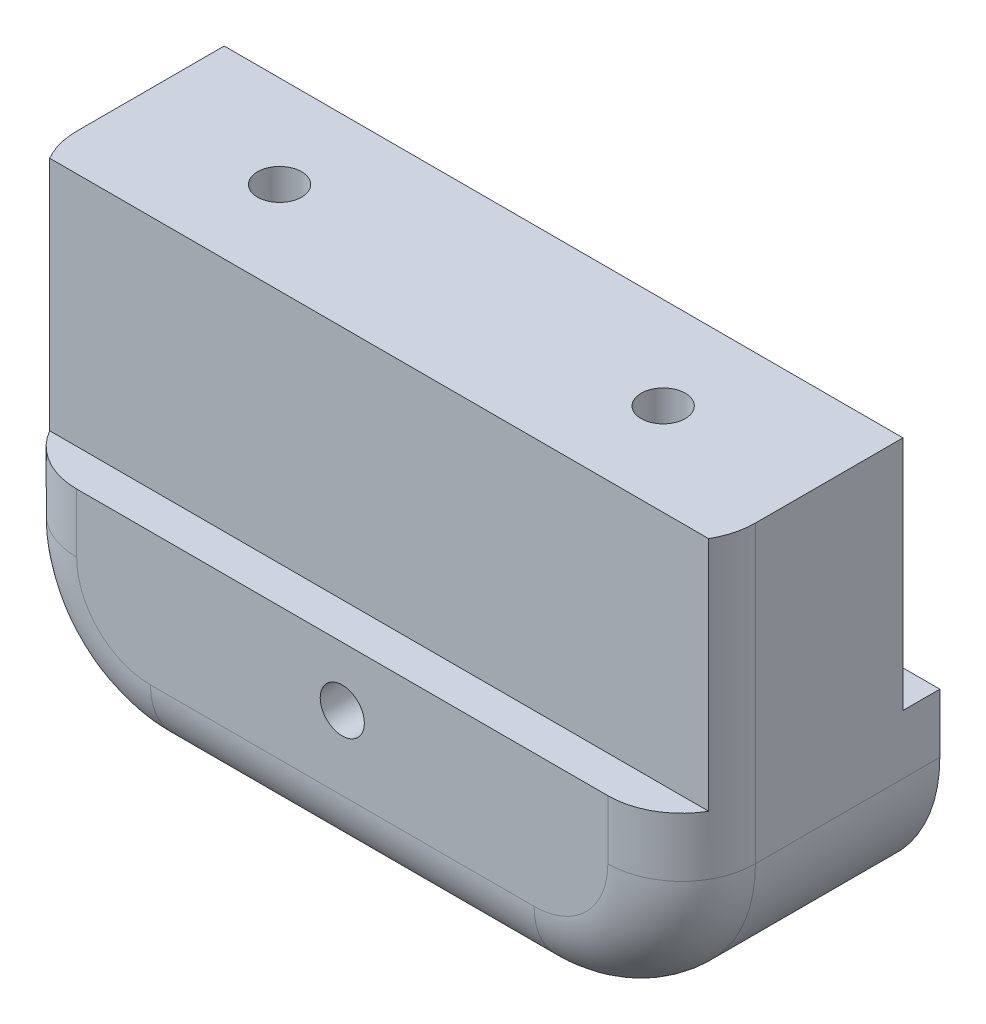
ISO-10303-21;
HEADER;
FILE_DESCRIPTION(('STEP AP214'),'2;1');
FILE_NAME('part.step','',(''),(''),'','','');
FILE_SCHEMA(('AUTOMOTIVE_DESIGN { 1 0 10303 214 1 1 1 1 }'));
ENDSEC;
DATA;
#1=APPLICATION_CONTEXT('core data for automotive mechanical design processes');
#2=APPLICATION_PROTOCOL_DEFINITION('international standard','automotive_design',2000,#1);
#3=PRODUCT_CONTEXT('',#1,'mechanical');
#4=PRODUCT('Part','Part','',(#3));
#5=PRODUCT_RELATED_PRODUCT_CATEGORY('part','',(#4));
#6=PRODUCT_DEFINITION_FORMATION('','',#4);
#7=PRODUCT_DEFINITION_CONTEXT('part definition',#1,'design');
#8=PRODUCT_DEFINITION('design','',#6,#7);
#9=PRODUCT_DEFINITION_SHAPE('','',#8);
#10=(LENGTH_UNIT() NAMED_UNIT(*) SI_UNIT(.MILLI.,.METRE.));
#11=(NAMED_UNIT(*) PLANE_ANGLE_UNIT() SI_UNIT($,.RADIAN.));
#12=(NAMED_UNIT(*) SI_UNIT($,.STERADIAN.) SOLID_ANGLE_UNIT());
#13=UNCERTAINTY_MEASURE_WITH_UNIT(LENGTH_MEASURE(1.E-05),#10,'distance_accuracy_value','');
#14=(GEOMETRIC_REPRESENTATION_CONTEXT(3) GLOBAL_UNCERTAINTY_ASSIGNED_CONTEXT((#13)) GLOBAL_UNIT_ASSIGNED_CONTEXT((#10,
#11,#12)) REPRESENTATION_CONTEXT('',''));
#15=CARTESIAN_POINT('',(0.,0.,0.));
#16=DIRECTION('',(0.,0.,1.));
#17=DIRECTION('',(1.,0.,0.));
#18=AXIS2_PLACEMENT_3D('',#15,#16,#17);
#19=CARTESIAN_POINT('',(75.5650000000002,-140.462,22.225));
#20=DIRECTION('',(0.,-1.,0.));
#21=DIRECTION('',(1.,0.,0.));
#22=AXIS2_PLACEMENT_3D('',#19,#20,#21);
#23=PLANE('',#22);
#24=CARTESIAN_POINT('',(128.905,-140.462,11.1125));
#25=DIRECTION('',(0.,1.,0.));
#26=DIRECTION('',(0.,0.,1.));
#27=AXIS2_PLACEMENT_3D('',#24,#25,#26);
#28=CIRCLE('',#27,1.89865);
#29=CARTESIAN_POINT('',(128.905,-140.462,13.01115));
#30=VERTEX_POINT('',#29);
#31=EDGE_CURVE('E160',#30,#30,#28,.T.);
#32=ORIENTED_EDGE('',*,*,#31,.F.);
#33=EDGE_LOOP('',(#32));
#34=FACE_BOUND('',#33,.T.);
#35=CARTESIAN_POINT('',(161.925,-140.462,11.1125));
#36=DIRECTION('',(0.,1.,0.));
#37=DIRECTION('',(0.,0.,1.));
#38=AXIS2_PLACEMENT_3D('',#35,#36,#37);
#39=CIRCLE('',#38,1.89865);
#40=CARTESIAN_POINT('',(161.925,-140.462,13.01115));
#41=VERTEX_POINT('',#40);
#42=EDGE_CURVE('E159',#41,#41,#39,.T.);
#43=ORIENTED_EDGE('',*,*,#42,.F.);
#44=EDGE_LOOP('',(#43));
#45=FACE_BOUND('',#44,.T.);
#46=DIRECTION('',(1.,0.,0.));
#47=VECTOR('',#46,1.);
#48=CARTESIAN_POINT('',(75.5650000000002,-140.462,3.175));
#49=LINE('',#48,#47);
#50=CARTESIAN_POINT('',(116.205,-140.462,3.175));
#51=VERTEX_POINT('',#50);
#52=CARTESIAN_POINT('',(174.625,-140.462,3.175));
#53=VERTEX_POINT('',#52);
#54=EDGE_CURVE('E309',#51,#53,#49,.T.);
#55=ORIENTED_EDGE('',*,*,#54,.F.);
#56=DIRECTION('',(0.,0.,1.));
#57=VECTOR('',#56,1.);
#58=CARTESIAN_POINT('',(116.205,-140.462,22.225));
#59=LINE('',#58,#57);
#60=CARTESIAN_POINT('',(116.205,-140.462,15.875));
#61=VERTEX_POINT('',#60);
#62=EDGE_CURVE('E341',#51,#61,#59,.T.);
#63=ORIENTED_EDGE('',*,*,#62,.T.);
#64=CARTESIAN_POINT('',(122.555,-140.462,15.875));
#65=DIRECTION('',(0.,-1.,0.));
#66=DIRECTION('',(1.,0.,0.));
#67=AXIS2_PLACEMENT_3D('',#64,#65,#66);
#68=CIRCLE('',#67,6.35);
#69=CARTESIAN_POINT('',(117.055738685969,-140.462,19.05));
#70=VERTEX_POINT('',#69);
#71=EDGE_CURVE('E193',#61,#70,#68,.F.);
#72=ORIENTED_EDGE('',*,*,#71,.T.);
#73=DIRECTION('',(1.,0.,0.));
#74=VECTOR('',#73,1.);
#75=CARTESIAN_POINT('',(174.625,-140.462,19.05));
#76=LINE('',#75,#74);
#77=CARTESIAN_POINT('',(173.774261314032,-140.462,19.05));
#78=VERTEX_POINT('',#77);
#79=EDGE_CURVE('E347',#70,#78,#76,.T.);
#80=ORIENTED_EDGE('',*,*,#79,.T.);
#81=CARTESIAN_POINT('',(168.275,-140.462,15.875));
#82=DIRECTION('',(0.,-1.,0.));
#83=DIRECTION('',(1.,0.,0.));
#84=AXIS2_PLACEMENT_3D('',#81,#82,#83);
#85=CIRCLE('',#84,6.35);
#86=CARTESIAN_POINT('',(174.625,-140.462,15.875));
#87=VERTEX_POINT('',#86);
#88=EDGE_CURVE('E191',#78,#87,#85,.F.);
#89=ORIENTED_EDGE('',*,*,#88,.T.);
#90=DIRECTION('',(0.,0.,-1.));
#91=VECTOR('',#90,1.);
#92=CARTESIAN_POINT('',(174.625,-140.462,22.225));
#93=LINE('',#92,#91);
#94=EDGE_CURVE('E169',#87,#53,#93,.T.);
#95=ORIENTED_EDGE('',*,*,#94,.T.);
#96=EDGE_LOOP('',(#55,#63,#72,#80,#89,#95));
#97=FACE_BOUND('',#96,.T.);
#98=ADVANCED_FACE('F39',(#34,#45,#97),#23,.F.);
#99=CARTESIAN_POINT('',(174.625,-140.462,22.225));
#100=DIRECTION('',(-1.,0.,0.));
#101=DIRECTION('',(0.,-1.,0.));
#102=AXIS2_PLACEMENT_3D('',#99,#100,#101);
#103=PLANE('',#102);
#104=DIRECTION('',(0.,1.,0.));
#105=VECTOR('',#104,1.);
#106=CARTESIAN_POINT('',(174.625,-140.462,0.));
#107=LINE('',#106,#105);
#108=CARTESIAN_POINT('',(174.625,-165.862,0.));
#109=VERTEX_POINT('',#108);
#110=CARTESIAN_POINT('',(174.625,-160.782,0.));
#111=VERTEX_POINT('',#110);
#112=EDGE_CURVE('E287',#109,#111,#107,.T.);
#113=ORIENTED_EDGE('',*,*,#112,.T.);
#114=DIRECTION('',(0.,0.,1.));
#115=VECTOR('',#114,1.);
#116=CARTESIAN_POINT('',(174.625,-160.782,22.225));
#117=LINE('',#116,#115);
#118=CARTESIAN_POINT('',(174.625,-160.782,3.175));
#119=VERTEX_POINT('',#118);
#120=EDGE_CURVE('E215',#111,#119,#117,.T.);
#121=ORIENTED_EDGE('',*,*,#120,.T.);
#122=DIRECTION('',(0.,-1.,0.));
#123=VECTOR('',#122,1.);
#124=CARTESIAN_POINT('',(174.625,-140.462,3.175));
#125=LINE('',#124,#123);
#126=EDGE_CURVE('E314',#53,#119,#125,.T.);
#127=ORIENTED_EDGE('',*,*,#126,.F.);
#128=ORIENTED_EDGE('',*,*,#94,.F.);
#129=DIRECTION('',(0.,1.,0.));
#130=VECTOR('',#129,1.);
#131=CARTESIAN_POINT('',(174.624999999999,-165.862,15.875));
#132=LINE('',#131,#130);
#133=CARTESIAN_POINT('',(174.625,-165.862,15.875));
#134=VERTEX_POINT('',#133);
#135=EDGE_CURVE('E205',#87,#134,#132,.F.);
#136=ORIENTED_EDGE('',*,*,#135,.T.);
#137=DIRECTION('',(0.,0.,-1.));
#138=VECTOR('',#137,1.);
#139=CARTESIAN_POINT('',(174.625,-165.862,22.225));
#140=LINE('',#139,#138);
#141=EDGE_CURVE('E167',#134,#109,#140,.T.);
#142=ORIENTED_EDGE('',*,*,#141,.T.);
#143=EDGE_LOOP('',(#113,#121,#127,#128,#136,#142));
#144=FACE_BOUND('',#143,.T.);
#145=ADVANCED_FACE('F271',(#144),#103,.F.);
#146=CARTESIAN_POINT('',(161.925,-165.862,22.225));
#147=DIRECTION('',(0.,0.,1.));
#148=DIRECTION('',(1.,0.,0.));
#149=AXIS2_PLACEMENT_3D('',#146,#147,#148);
#150=PLANE('',#149);
#151=DIRECTION('',(-1.,0.,0.));
#152=VECTOR('',#151,1.);
#153=CARTESIAN_POINT('',(174.625,-160.782,22.225));
#154=LINE('',#153,#152);
#155=CARTESIAN_POINT('',(168.275,-160.782,22.225));
#156=VERTEX_POINT('',#155);
#157=CARTESIAN_POINT('',(122.555,-160.782,22.225));
#158=VERTEX_POINT('',#157);
#159=EDGE_CURVE('E343',#156,#158,#154,.T.);
#160=ORIENTED_EDGE('',*,*,#159,.T.);
#161=DIRECTION('',(0.,-1.,0.));
#162=VECTOR('',#161,1.);
#163=CARTESIAN_POINT('',(122.555,-165.862,22.225));
#164=LINE('',#163,#162);
#165=CARTESIAN_POINT('',(122.555,-165.862,22.225));
#166=VERTEX_POINT('',#165);
#167=EDGE_CURVE('E185',#158,#166,#164,.T.);
#168=ORIENTED_EDGE('',*,*,#167,.T.);
#169=CARTESIAN_POINT('',(128.905,-165.862,22.225));
#170=DIRECTION('',(0.,0.,1.));
#171=DIRECTION('',(1.,0.,0.));
#172=AXIS2_PLACEMENT_3D('',#169,#170,#171);
#173=CIRCLE('',#172,6.35);
#174=CARTESIAN_POINT('',(128.905,-172.212,22.225));
#175=VERTEX_POINT('',#174);
#176=EDGE_CURVE('E183',#166,#175,#173,.T.);
#177=ORIENTED_EDGE('',*,*,#176,.T.);
#178=DIRECTION('',(1.,0.,0.));
#179=VECTOR('',#178,1.);
#180=CARTESIAN_POINT('',(161.925,-172.212,22.225));
#181=LINE('',#180,#179);
#182=CARTESIAN_POINT('',(161.925,-172.212,22.225));
#183=VERTEX_POINT('',#182);
#184=EDGE_CURVE('E177',#175,#183,#181,.T.);
#185=ORIENTED_EDGE('',*,*,#184,.T.);
#186=CARTESIAN_POINT('',(161.925,-165.862,22.225));
#187=DIRECTION('',(0.,0.,1.));
#188=DIRECTION('',(1.,0.,0.));
#189=AXIS2_PLACEMENT_3D('',#186,#187,#188);
#190=CIRCLE('',#189,6.34999999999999);
#191=CARTESIAN_POINT('',(168.275,-165.862,22.225));
#192=VERTEX_POINT('',#191);
#193=EDGE_CURVE('E179',#183,#192,#190,.T.);
#194=ORIENTED_EDGE('',*,*,#193,.T.);
#195=DIRECTION('',(0.,1.,0.));
#196=VECTOR('',#195,1.);
#197=CARTESIAN_POINT('',(168.275,-160.782,22.225));
#198=LINE('',#197,#196);
#199=EDGE_CURVE('E181',#192,#156,#198,.T.);
#200=ORIENTED_EDGE('',*,*,#199,.T.);
#201=EDGE_LOOP('',(#160,#168,#177,#185,#194,#200));
#202=FACE_BOUND('',#201,.T.);
#203=CARTESIAN_POINT('',(145.415,-165.862,22.225));
#204=DIRECTION('',(0.,0.,-1.));
#205=DIRECTION('',(-1.,0.,0.));
#206=AXIS2_PLACEMENT_3D('',#203,#204,#205);
#207=CIRCLE('',#206,1.89865);
#208=CARTESIAN_POINT('',(143.51635,-165.862,22.225));
#209=VERTEX_POINT('',#208);
#210=EDGE_CURVE('E299',#209,#209,#207,.T.);
#211=ORIENTED_EDGE('',*,*,#210,.T.);
#212=EDGE_LOOP('',(#211));
#213=FACE_BOUND('',#212,.T.);
#214=ADVANCED_FACE('F268',(#202,#213),#150,.T.);
#215=CARTESIAN_POINT('',(161.925,-165.862,22.225));
#216=DIRECTION('',(0.,0.,-1.));
#217=DIRECTION('',(-1.,0.,0.));
#218=AXIS2_PLACEMENT_3D('',#215,#216,#217);
#219=CYLINDRICAL_SURFACE('',#218,12.7);
#220=DIRECTION('',(0.,0.,-1.));
#221=VECTOR('',#220,1.);
#222=CARTESIAN_POINT('',(161.925,-178.562,22.225));
#223=LINE('',#222,#221);
#224=CARTESIAN_POINT('',(161.925,-178.562,15.875));
#225=VERTEX_POINT('',#224);
#226=CARTESIAN_POINT('',(161.925,-178.562,13.01115));
#227=VERTEX_POINT('',#226);
#228=EDGE_CURVE('E303',#225,#227,#223,.T.);
#229=ORIENTED_EDGE('',*,*,#228,.T.);
#230=CARTESIAN_POINT('',(161.925,-178.562,13.01115));
#231=CARTESIAN_POINT('',(161.978102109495,-178.562001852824,13.0111499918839));
#232=CARTESIAN_POINT('',(162.031178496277,-178.561666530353,13.0089208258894));
#233=CARTESIAN_POINT('',(162.136945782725,-178.560341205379,13.0000300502));
#234=CARTESIAN_POINT('',(162.189636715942,-178.559351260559,12.9933688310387));
#235=CARTESIAN_POINT('',(162.346430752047,-178.55543424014,12.9668114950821));
#236=CARTESIAN_POINT('',(162.449474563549,-178.551559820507,12.9403414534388));
#237=CARTESIAN_POINT('',(162.649591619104,-178.541709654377,12.8706480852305));
#238=CARTESIAN_POINT('',(162.746663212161,-178.535733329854,12.8274201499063));
#239=CARTESIAN_POINT('',(162.932187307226,-178.522340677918,12.7254610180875));
#240=CARTESIAN_POINT('',(163.020640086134,-178.514924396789,12.6667303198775));
#241=CARTESIAN_POINT('',(163.187074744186,-178.499413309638,12.5349572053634));
#242=CARTESIAN_POINT('',(163.264980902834,-178.491314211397,12.461819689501));
#243=CARTESIAN_POINT('',(163.40747197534,-178.475382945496,12.3035045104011));
#244=CARTESIAN_POINT('',(163.472054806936,-178.46755081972,12.2183249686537));
#245=CARTESIAN_POINT('',(163.586352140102,-178.452999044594,12.0378353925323));
#246=CARTESIAN_POINT('',(163.635992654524,-178.446285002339,11.9424780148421));
#247=CARTESIAN_POINT('',(163.718521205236,-178.434789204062,11.7446676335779));
#248=CARTESIAN_POINT('',(163.751411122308,-178.430007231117,11.6422154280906));
#249=CARTESIAN_POINT('',(163.799271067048,-178.422959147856,11.4339245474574));
#250=CARTESIAN_POINT('',(163.814372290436,-178.420674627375,11.3281166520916));
#251=CARTESIAN_POINT('',(163.826632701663,-178.418824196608,11.1154432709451));
#252=CARTESIAN_POINT('',(163.823792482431,-178.41925819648,11.008577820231));
#253=CARTESIAN_POINT('',(163.800357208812,-178.422779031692,10.7977550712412));
#254=CARTESIAN_POINT('',(163.779908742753,-178.425843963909,10.6937810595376));
#255=CARTESIAN_POINT('',(163.722066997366,-178.434247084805,10.4907572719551));
#256=CARTESIAN_POINT('',(163.684673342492,-178.439585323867,10.3917076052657));
#257=CARTESIAN_POINT('',(163.593849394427,-178.451957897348,10.2008955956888));
#258=CARTESIAN_POINT('',(163.540356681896,-178.458998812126,10.1091634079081));
#259=CARTESIAN_POINT('',(163.418899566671,-178.473978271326,9.93592538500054));
#260=CARTESIAN_POINT('',(163.350934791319,-178.48191683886,9.85441981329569));
#261=CARTESIAN_POINT('',(163.201668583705,-178.497893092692,9.70310509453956));
#262=CARTESIAN_POINT('',(163.120242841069,-178.505930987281,9.63341855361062));
#263=CARTESIAN_POINT('',(162.946757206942,-178.521130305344,9.50866106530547));
#264=CARTESIAN_POINT('',(162.854694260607,-178.528291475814,9.45359433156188));
#265=CARTESIAN_POINT('',(162.662429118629,-178.540938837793,9.3596338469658));
#266=CARTESIAN_POINT('',(162.562217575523,-178.546423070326,9.32075899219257));
#267=CARTESIAN_POINT('',(162.356658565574,-178.555076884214,9.26048042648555));
#268=CARTESIAN_POINT('',(162.251319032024,-178.558249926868,9.23905058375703));
#269=CARTESIAN_POINT('',(162.108497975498,-178.560727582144,9.22237774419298));
#270=CARTESIAN_POINT('',(162.071840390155,-178.561204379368,9.21917841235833));
#271=CARTESIAN_POINT('',(161.998460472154,-178.561840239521,9.21491736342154));
#272=CARTESIAN_POINT('',(161.96173835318,-178.561999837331,9.21385204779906));
#273=CARTESIAN_POINT('',(161.925,-178.562,9.21385));
#274=B_SPLINE_CURVE_WITH_KNOTS('',3,(#230,#231,#232,#233,#234,#235,#236,#237,#238,#239,#240,
#241,#242,#243,#244,#245,#246,#247,#248,#249,#250,#251,#252,#253,#254,#255,#256,#257,#258,#259,
#260,#261,#262,#263,#264,#265,#266,#267,#268,#269,#270,#271,#272,#273),.UNSPECIFIED.,.F.,.F.,(4,
2,2,2,2,2,2,2,2,2,2,2,2,2,2,2,2,2,2,2,2,4),(0.,0.15920756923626,0.318401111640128,
0.636138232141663,0.95396279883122,1.27177715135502,1.59176429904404,1.91180141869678,
2.23339808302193,2.55495862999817,2.87413244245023,3.19329570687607,3.50982735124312,
3.82636601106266,4.14414812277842,4.46193841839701,4.78284672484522,5.10384742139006,
5.4252216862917,5.74611365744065,5.85646674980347,5.96663360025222),.UNSPECIFIED.);
#275=CARTESIAN_POINT('',(161.925,-178.562,9.21385));
#276=VERTEX_POINT('',#275);
#277=EDGE_CURVE('E52',#227,#276,#274,.T.);
#278=ORIENTED_EDGE('',*,*,#277,.T.);
#279=CARTESIAN_POINT('',(161.925,-178.562,0.));
#280=VERTEX_POINT('',#279);
#281=EDGE_CURVE('E297',#276,#280,#223,.T.);
#282=ORIENTED_EDGE('',*,*,#281,.T.);
#283=CARTESIAN_POINT('',(161.925,-165.862,0.));
#284=DIRECTION('',(0.,0.,1.));
#285=DIRECTION('',(1.,0.,0.));
#286=AXIS2_PLACEMENT_3D('',#283,#284,#285);
#287=CIRCLE('',#286,12.7);
#288=EDGE_CURVE('E295',#280,#109,#287,.T.);
#289=ORIENTED_EDGE('',*,*,#288,.T.);
#290=ORIENTED_EDGE('',*,*,#141,.F.);
#291=CARTESIAN_POINT('',(161.925,-165.862,15.875));
#292=DIRECTION('',(0.,0.,1.));
#293=DIRECTION('',(1.,0.,0.));
#294=AXIS2_PLACEMENT_3D('',#291,#292,#293);
#295=CIRCLE('',#294,12.7);
#296=EDGE_CURVE('E207',#134,#225,#295,.F.);
#297=ORIENTED_EDGE('',*,*,#296,.T.);
#298=EDGE_LOOP('',(#229,#278,#282,#289,#290,#297));
#299=FACE_BOUND('',#298,.T.);
#300=ADVANCED_FACE('F233',(#299),#219,.T.);
#301=CARTESIAN_POINT('',(161.925,-178.562,22.225));
#302=DIRECTION('',(0.,1.,0.));
#303=DIRECTION('',(-1.,0.,0.));
#304=AXIS2_PLACEMENT_3D('',#301,#302,#303);
#305=PLANE('',#304);
#306=DIRECTION('',(0.,0.,-1.));
#307=VECTOR('',#306,1.);
#308=CARTESIAN_POINT('',(128.905,-178.562,22.225));
#309=LINE('',#308,#307);
#310=CARTESIAN_POINT('',(128.905,-178.562,15.875));
#311=VERTEX_POINT('',#310);
#312=CARTESIAN_POINT('',(128.905,-178.562,13.01115));
#313=VERTEX_POINT('',#312);
#314=EDGE_CURVE('E158',#311,#313,#309,.T.);
#315=ORIENTED_EDGE('',*,*,#314,.T.);
#316=CARTESIAN_POINT('',(128.905,-178.562,11.1125));
#317=DIRECTION('',(0.,1.,0.));
#318=DIRECTION('',(0.,0.,1.));
#319=AXIS2_PLACEMENT_3D('',#316,#317,#318);
#320=CIRCLE('',#319,1.89865);
#321=CARTESIAN_POINT('',(128.905,-178.562,9.21385));
#322=VERTEX_POINT('',#321);
#323=EDGE_CURVE('E57',#313,#322,#320,.T.);
#324=ORIENTED_EDGE('',*,*,#323,.T.);
#325=CARTESIAN_POINT('',(128.905,-178.562,0.));
#326=VERTEX_POINT('',#325);
#327=EDGE_CURVE('E156',#322,#326,#309,.T.);
#328=ORIENTED_EDGE('',*,*,#327,.T.);
#329=DIRECTION('',(1.,0.,0.));
#330=VECTOR('',#329,1.);
#331=CARTESIAN_POINT('',(161.925,-178.562,0.));
#332=LINE('',#331,#330);
#333=EDGE_CURVE('E294',#326,#280,#332,.T.);
#334=ORIENTED_EDGE('',*,*,#333,.T.);
#335=ORIENTED_EDGE('',*,*,#281,.F.);
#336=CARTESIAN_POINT('',(161.925,-178.562,11.1125));
#337=DIRECTION('',(0.,1.,0.));
#338=DIRECTION('',(0.,0.,1.));
#339=AXIS2_PLACEMENT_3D('',#336,#337,#338);
#340=CIRCLE('',#339,1.89865);
#341=EDGE_CURVE('E64',#276,#227,#340,.T.);
#342=ORIENTED_EDGE('',*,*,#341,.T.);
#343=ORIENTED_EDGE('',*,*,#228,.F.);
#344=DIRECTION('',(1.,0.,0.));
#345=VECTOR('',#344,1.);
#346=CARTESIAN_POINT('',(128.905,-178.562,15.875));
#347=LINE('',#346,#345);
#348=EDGE_CURVE('E209',#225,#311,#347,.F.);
#349=ORIENTED_EDGE('',*,*,#348,.T.);
#350=EDGE_LOOP('',(#315,#324,#328,#334,#335,#342,#343,#349));
#351=FACE_BOUND('',#350,.T.);
#352=ADVANCED_FACE('F154',(#351),#305,.F.);
#353=CARTESIAN_POINT('',(161.925,-165.862,0.));
#354=DIRECTION('',(0.,0.,1.));
#355=DIRECTION('',(1.,0.,0.));
#356=AXIS2_PLACEMENT_3D('',#353,#354,#355);
#357=PLANE('',#356);
#358=CARTESIAN_POINT('',(145.415,-165.862,0.));
#359=DIRECTION('',(0.,0.,-1.));
#360=DIRECTION('',(-1.,0.,0.));
#361=AXIS2_PLACEMENT_3D('',#358,#359,#360);
#362=CIRCLE('',#361,1.89865);
#363=CARTESIAN_POINT('',(143.51635,-165.862,0.));
#364=VERTEX_POINT('',#363);
#365=EDGE_CURVE('E349',#364,#364,#362,.T.);
#366=ORIENTED_EDGE('',*,*,#365,.F.);
#367=EDGE_LOOP('',(#366));
#368=FACE_BOUND('',#367,.T.);
#369=DIRECTION('',(0.,-1.,0.));
#370=VECTOR('',#369,1.);
#371=CARTESIAN_POINT('',(116.205,-133.284500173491,0.));
#372=LINE('',#371,#370);
#373=CARTESIAN_POINT('',(116.205,-160.782,0.));
#374=VERTEX_POINT('',#373);
#375=CARTESIAN_POINT('',(116.205,-165.862,0.));
#376=VERTEX_POINT('',#375);
#377=EDGE_CURVE('E224',#374,#376,#372,.T.);
#378=ORIENTED_EDGE('',*,*,#377,.F.);
#379=DIRECTION('',(-1.,0.,0.));
#380=VECTOR('',#379,1.);
#381=CARTESIAN_POINT('',(175.838677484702,-160.782,0.));
#382=LINE('',#381,#380);
#383=EDGE_CURVE('E329',#111,#374,#382,.T.);
#384=ORIENTED_EDGE('',*,*,#383,.F.);
#385=ORIENTED_EDGE('',*,*,#112,.F.);
#386=ORIENTED_EDGE('',*,*,#288,.F.);
#387=ORIENTED_EDGE('',*,*,#333,.F.);
#388=CARTESIAN_POINT('',(128.905,-165.862,0.));
#389=DIRECTION('',(0.,0.,1.));
#390=DIRECTION('',(1.,0.,0.));
#391=AXIS2_PLACEMENT_3D('',#388,#389,#390);
#392=CIRCLE('',#391,12.7);
#393=EDGE_CURVE('E165',#326,#376,#392,.F.);
#394=ORIENTED_EDGE('',*,*,#393,.T.);
#395=EDGE_LOOP('',(#378,#384,#385,#386,#387,#394));
#396=FACE_BOUND('',#395,.T.);
#397=ADVANCED_FACE('F266',(#368,#396),#357,.F.);
#398=CARTESIAN_POINT('',(145.415,-165.862,0.));
#399=DIRECTION('',(0.,0.,-1.));
#400=DIRECTION('',(-1.,0.,0.));
#401=AXIS2_PLACEMENT_3D('',#398,#399,#400);
#402=CYLINDRICAL_SURFACE('',#401,1.89865);
#403=ORIENTED_EDGE('',*,*,#210,.F.);
#404=EDGE_LOOP('',(#403));
#405=FACE_BOUND('',#404,.T.);
#406=ORIENTED_EDGE('',*,*,#365,.T.);
#407=EDGE_LOOP('',(#406));
#408=FACE_BOUND('',#407,.T.);
#409=ADVANCED_FACE('F262',(#405,#408),#402,.F.);
#410=CARTESIAN_POINT('',(174.625,-160.782,19.05));
#411=DIRECTION('',(0.,1.,0.));
#412=DIRECTION('',(0.,0.,1.));
#413=AXIS2_PLACEMENT_3D('',#410,#411,#412);
#414=PLANE('',#413);
#415=DIRECTION('',(-1.,0.,0.));
#416=VECTOR('',#415,1.);
#417=CARTESIAN_POINT('',(174.625,-160.782,19.05));
#418=LINE('',#417,#416);
#419=CARTESIAN_POINT('',(173.774261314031,-160.782,19.05));
#420=VERTEX_POINT('',#419);
#421=CARTESIAN_POINT('',(117.055738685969,-160.782,19.05));
#422=VERTEX_POINT('',#421);
#423=EDGE_CURVE('E344',#420,#422,#418,.T.);
#424=ORIENTED_EDGE('',*,*,#423,.T.);
#425=CARTESIAN_POINT('',(122.555,-160.782,15.875));
#426=DIRECTION('',(0.,1.,0.));
#427=DIRECTION('',(0.,0.,1.));
#428=AXIS2_PLACEMENT_3D('',#425,#426,#427);
#429=CIRCLE('',#428,6.35);
#430=EDGE_CURVE('E201',#422,#158,#429,.T.);
#431=ORIENTED_EDGE('',*,*,#430,.T.);
#432=ORIENTED_EDGE('',*,*,#159,.F.);
#433=CARTESIAN_POINT('',(168.275,-160.782,15.875));
#434=DIRECTION('',(0.,1.,0.));
#435=DIRECTION('',(0.,0.,1.));
#436=AXIS2_PLACEMENT_3D('',#433,#434,#435);
#437=CIRCLE('',#436,6.35);
#438=EDGE_CURVE('E199',#156,#420,#437,.T.);
#439=ORIENTED_EDGE('',*,*,#438,.T.);
#440=EDGE_LOOP('',(#424,#431,#432,#439));
#441=FACE_BOUND('',#440,.T.);
#442=ADVANCED_FACE('F258',(#441),#414,.T.);
#443=CARTESIAN_POINT('',(0.,0.,19.05));
#444=DIRECTION('',(0.,0.,1.));
#445=DIRECTION('',(1.,0.,0.));
#446=AXIS2_PLACEMENT_3D('',#443,#444,#445);
#447=PLANE('',#446);
#448=ORIENTED_EDGE('',*,*,#79,.F.);
#449=DIRECTION('',(0.,1.,0.));
#450=VECTOR('',#449,1.);
#451=CARTESIAN_POINT('',(117.055738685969,-140.462,19.05));
#452=LINE('',#451,#450);
#453=EDGE_CURVE('E197',#70,#422,#452,.F.);
#454=ORIENTED_EDGE('',*,*,#453,.T.);
#455=ORIENTED_EDGE('',*,*,#423,.F.);
#456=DIRECTION('',(0.,-1.,0.));
#457=VECTOR('',#456,1.);
#458=CARTESIAN_POINT('',(173.774261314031,-160.782,19.05));
#459=LINE('',#458,#457);
#460=EDGE_CURVE('E195',#420,#78,#459,.F.);
#461=ORIENTED_EDGE('',*,*,#460,.T.);
#462=EDGE_LOOP('',(#448,#454,#455,#461));
#463=FACE_BOUND('',#462,.T.);
#464=ADVANCED_FACE('F254',(#463),#447,.T.);
#465=CARTESIAN_POINT('',(116.205,-133.284500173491,22.225));
#466=DIRECTION('',(1.,0.,0.));
#467=DIRECTION('',(0.,0.,-1.));
#468=AXIS2_PLACEMENT_3D('',#465,#466,#467);
#469=PLANE('',#468);
#470=DIRECTION('',(0.,1.,0.));
#471=VECTOR('',#470,1.);
#472=CARTESIAN_POINT('',(116.205,-133.284500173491,3.175));
#473=LINE('',#472,#471);
#474=CARTESIAN_POINT('',(116.205,-160.782,3.175));
#475=VERTEX_POINT('',#474);
#476=EDGE_CURVE('E211',#475,#51,#473,.T.);
#477=ORIENTED_EDGE('',*,*,#476,.F.);
#478=DIRECTION('',(0.,0.,-1.));
#479=VECTOR('',#478,1.);
#480=CARTESIAN_POINT('',(116.205,-160.782,22.225));
#481=LINE('',#480,#479);
#482=EDGE_CURVE('E226',#475,#374,#481,.T.);
#483=ORIENTED_EDGE('',*,*,#482,.T.);
#484=ORIENTED_EDGE('',*,*,#377,.T.);
#485=DIRECTION('',(0.,0.,-1.));
#486=VECTOR('',#485,1.);
#487=CARTESIAN_POINT('',(116.205,-165.862,22.225));
#488=LINE('',#487,#486);
#489=CARTESIAN_POINT('',(116.205,-165.862,15.875));
#490=VERTEX_POINT('',#489);
#491=EDGE_CURVE('E174',#376,#490,#488,.F.);
#492=ORIENTED_EDGE('',*,*,#491,.T.);
#493=DIRECTION('',(0.,-1.,0.));
#494=VECTOR('',#493,1.);
#495=CARTESIAN_POINT('',(116.205,-160.782,15.875));
#496=LINE('',#495,#494);
#497=EDGE_CURVE('E188',#490,#61,#496,.F.);
#498=ORIENTED_EDGE('',*,*,#497,.T.);
#499=ORIENTED_EDGE('',*,*,#62,.F.);
#500=EDGE_LOOP('',(#477,#483,#484,#492,#498,#499));
#501=FACE_BOUND('',#500,.T.);
#502=ADVANCED_FACE('F251',(#501),#469,.F.);
#503=CARTESIAN_POINT('',(128.905,-165.862,22.225));
#504=DIRECTION('',(0.,0.,-1.));
#505=DIRECTION('',(-1.,0.,0.));
#506=AXIS2_PLACEMENT_3D('',#503,#504,#505);
#507=CYLINDRICAL_SURFACE('',#506,12.7);
#508=CARTESIAN_POINT('',(128.905,-178.562,13.01115));
#509=CARTESIAN_POINT('',(128.851897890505,-178.562001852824,13.0111499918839));
#510=CARTESIAN_POINT('',(128.798821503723,-178.561666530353,13.0089208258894));
#511=CARTESIAN_POINT('',(128.693054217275,-178.560341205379,13.0000300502));
#512=CARTESIAN_POINT('',(128.640363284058,-178.559351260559,12.9933688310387));
#513=CARTESIAN_POINT('',(128.483569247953,-178.55543424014,12.9668114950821));
#514=CARTESIAN_POINT('',(128.380525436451,-178.551559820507,12.9403414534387));
#515=CARTESIAN_POINT('',(128.180408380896,-178.541709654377,12.8706480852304));
#516=CARTESIAN_POINT('',(128.083336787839,-178.535733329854,12.8274201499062));
#517=CARTESIAN_POINT('',(127.897812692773,-178.522340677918,12.7254610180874));
#518=CARTESIAN_POINT('',(127.809359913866,-178.514924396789,12.6667303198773));
#519=CARTESIAN_POINT('',(127.642925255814,-178.499413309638,12.5349572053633));
#520=CARTESIAN_POINT('',(127.565019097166,-178.491314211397,12.4618196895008));
#521=CARTESIAN_POINT('',(127.42252802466,-178.475382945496,12.3035045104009));
#522=CARTESIAN_POINT('',(127.357945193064,-178.46755081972,12.2183249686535));
#523=CARTESIAN_POINT('',(127.243647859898,-178.452999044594,12.0378353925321));
#524=CARTESIAN_POINT('',(127.194007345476,-178.446285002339,11.9424780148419));
#525=CARTESIAN_POINT('',(127.111478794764,-178.434789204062,11.7446676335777));
#526=CARTESIAN_POINT('',(127.078588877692,-178.430007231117,11.6422154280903));
#527=CARTESIAN_POINT('',(127.030728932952,-178.422959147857,11.4339245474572));
#528=CARTESIAN_POINT('',(127.015627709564,-178.420674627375,11.3281166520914));
#529=CARTESIAN_POINT('',(127.003367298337,-178.418824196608,11.1154432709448));
#530=CARTESIAN_POINT('',(127.006207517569,-178.41925819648,11.0085778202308));
#531=CARTESIAN_POINT('',(127.029642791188,-178.422779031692,10.797755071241));
#532=CARTESIAN_POINT('',(127.050091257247,-178.425843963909,10.6937810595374));
#533=CARTESIAN_POINT('',(127.107933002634,-178.434247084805,10.4907572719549));
#534=CARTESIAN_POINT('',(127.145326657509,-178.439585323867,10.3917076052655));
#535=CARTESIAN_POINT('',(127.236150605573,-178.451957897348,10.2008955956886));
#536=CARTESIAN_POINT('',(127.289643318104,-178.458998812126,10.1091634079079));
#537=CARTESIAN_POINT('',(127.411100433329,-178.473978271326,9.93592538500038));
#538=CARTESIAN_POINT('',(127.479065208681,-178.48191683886,9.85441981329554));
#539=CARTESIAN_POINT('',(127.628331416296,-178.497893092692,9.70310509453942));
#540=CARTESIAN_POINT('',(127.709757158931,-178.505930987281,9.63341855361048));
#541=CARTESIAN_POINT('',(127.883242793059,-178.521130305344,9.50866106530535));
#542=CARTESIAN_POINT('',(127.975305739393,-178.528291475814,9.45359433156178));
#543=CARTESIAN_POINT('',(128.167570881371,-178.540938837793,9.35963384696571));
#544=CARTESIAN_POINT('',(128.267782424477,-178.546423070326,9.32075899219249));
#545=CARTESIAN_POINT('',(128.473341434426,-178.555076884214,9.26048042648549));
#546=CARTESIAN_POINT('',(128.578680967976,-178.558249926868,9.23905058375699));
#547=CARTESIAN_POINT('',(128.721502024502,-178.560727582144,9.22237774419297));
#548=CARTESIAN_POINT('',(128.758159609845,-178.561204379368,9.21917841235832));
#549=CARTESIAN_POINT('',(128.831539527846,-178.561840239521,9.21491736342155));
#550=CARTESIAN_POINT('',(128.86826164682,-178.561999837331,9.21385204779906));
#551=CARTESIAN_POINT('',(128.905,-178.562,9.21385));
#552=B_SPLINE_CURVE_WITH_KNOTS('',3,(#508,#509,#510,#511,#512,#513,#514,#515,#516,#517,#518,
#519,#520,#521,#522,#523,#524,#525,#526,#527,#528,#529,#530,#531,#532,#533,#534,#535,#536,#537,
#538,#539,#540,#541,#542,#543,#544,#545,#546,#547,#548,#549,#550,#551),.UNSPECIFIED.,.F.,.F.,(4,
2,2,2,2,2,2,2,2,2,2,2,2,2,2,2,2,2,2,2,2,4),(0.,0.159207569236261,0.318401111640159,
0.636138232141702,0.953962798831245,1.27177715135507,1.59176429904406,1.91180141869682,
2.233398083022,2.55495862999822,2.87413244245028,3.19329570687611,3.50982735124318,
3.82636601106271,4.14414812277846,4.46193841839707,4.78284672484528,5.10384742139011,
5.42522168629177,5.74611365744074,5.85646674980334,5.96663360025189),.UNSPECIFIED.);
#553=EDGE_CURVE('E11',#313,#322,#552,.T.);
#554=ORIENTED_EDGE('',*,*,#553,.F.);
#555=ORIENTED_EDGE('',*,*,#314,.F.);
#556=CARTESIAN_POINT('',(128.905,-165.862,15.875));
#557=DIRECTION('',(0.,0.,1.));
#558=DIRECTION('',(1.,0.,0.));
#559=AXIS2_PLACEMENT_3D('',#556,#557,#558);
#560=CIRCLE('',#559,12.7);
#561=EDGE_CURVE('E203',#311,#490,#560,.F.);
#562=ORIENTED_EDGE('',*,*,#561,.T.);
#563=ORIENTED_EDGE('',*,*,#491,.F.);
#564=ORIENTED_EDGE('',*,*,#393,.F.);
#565=ORIENTED_EDGE('',*,*,#327,.F.);
#566=EDGE_LOOP('',(#554,#555,#562,#563,#564,#565));
#567=FACE_BOUND('',#566,.T.);
#568=ADVANCED_FACE('F162',(#567),#507,.T.);
#569=CARTESIAN_POINT('',(168.274999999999,-165.862,15.875));
#570=DIRECTION('',(0.,-1.,0.));
#571=DIRECTION('',(1.,0.,0.));
#572=AXIS2_PLACEMENT_3D('',#569,#570,#571);
#573=CYLINDRICAL_SURFACE('',#572,6.35);
#574=ORIENTED_EDGE('',*,*,#438,.F.);
#575=ORIENTED_EDGE('',*,*,#199,.F.);
#576=CARTESIAN_POINT('',(168.274999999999,-165.862,15.875));
#577=DIRECTION('',(0.,-1.,0.));
#578=DIRECTION('',(1.,0.,0.));
#579=AXIS2_PLACEMENT_3D('',#576,#577,#578);
#580=CIRCLE('',#579,6.35);
#581=EDGE_CURVE('E221',#134,#192,#580,.T.);
#582=ORIENTED_EDGE('',*,*,#581,.F.);
#583=ORIENTED_EDGE('',*,*,#135,.F.);
#584=ORIENTED_EDGE('',*,*,#88,.F.);
#585=ORIENTED_EDGE('',*,*,#460,.F.);
#586=EDGE_LOOP('',(#574,#575,#582,#583,#584,#585));
#587=FACE_BOUND('',#586,.T.);
#588=ADVANCED_FACE('F41',(#587),#573,.T.);
#589=CARTESIAN_POINT('',(161.925,-165.862,15.875));
#590=DIRECTION('',(0.,0.,1.));
#591=DIRECTION('',(1.,0.,0.));
#592=AXIS2_PLACEMENT_3D('',#589,#590,#591);
#593=DEGENERATE_TOROIDAL_SURFACE('',#592,6.34999999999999,6.35,.T.);
#594=ORIENTED_EDGE('',*,*,#581,.T.);
#595=ORIENTED_EDGE('',*,*,#193,.F.);
#596=CARTESIAN_POINT('',(161.925,-172.212,15.875));
#597=DIRECTION('',(-1.,0.,0.));
#598=DIRECTION('',(0.,0.,1.));
#599=AXIS2_PLACEMENT_3D('',#596,#597,#598);
#600=CIRCLE('',#599,6.35);
#601=EDGE_CURVE('E218',#225,#183,#600,.T.);
#602=ORIENTED_EDGE('',*,*,#601,.F.);
#603=ORIENTED_EDGE('',*,*,#296,.F.);
#604=EDGE_LOOP('',(#594,#595,#602,#603));
#605=FACE_BOUND('',#604,.T.);
#606=ADVANCED_FACE('F324',(#605),#593,.T.);
#607=CARTESIAN_POINT('',(161.925,-172.212,15.875));
#608=DIRECTION('',(-1.,0.,0.));
#609=DIRECTION('',(0.,-1.,0.));
#610=AXIS2_PLACEMENT_3D('',#607,#608,#609);
#611=CYLINDRICAL_SURFACE('',#610,6.35);
#612=ORIENTED_EDGE('',*,*,#601,.T.);
#613=ORIENTED_EDGE('',*,*,#184,.F.);
#614=CARTESIAN_POINT('',(128.905,-172.212,15.875));
#615=DIRECTION('',(-1.,0.,0.));
#616=DIRECTION('',(0.,0.,1.));
#617=AXIS2_PLACEMENT_3D('',#614,#615,#616);
#618=CIRCLE('',#617,6.35);
#619=EDGE_CURVE('E214',#311,#175,#618,.T.);
#620=ORIENTED_EDGE('',*,*,#619,.F.);
#621=ORIENTED_EDGE('',*,*,#348,.F.);
#622=EDGE_LOOP('',(#612,#613,#620,#621));
#623=FACE_BOUND('',#622,.T.);
#624=ADVANCED_FACE('F373',(#623),#611,.T.);
#625=CARTESIAN_POINT('',(128.905,-165.862,15.875));
#626=DIRECTION('',(0.,0.,1.));
#627=DIRECTION('',(1.,0.,0.));
#628=AXIS2_PLACEMENT_3D('',#625,#626,#627);
#629=DEGENERATE_TOROIDAL_SURFACE('',#628,6.35,6.35,.T.);
#630=ORIENTED_EDGE('',*,*,#619,.T.);
#631=ORIENTED_EDGE('',*,*,#176,.F.);
#632=CARTESIAN_POINT('',(122.555,-165.862,15.875));
#633=DIRECTION('',(0.,1.,0.));
#634=DIRECTION('',(0.,0.,1.));
#635=AXIS2_PLACEMENT_3D('',#632,#633,#634);
#636=CIRCLE('',#635,6.35);
#637=EDGE_CURVE('E212',#490,#166,#636,.T.);
#638=ORIENTED_EDGE('',*,*,#637,.F.);
#639=ORIENTED_EDGE('',*,*,#561,.F.);
#640=EDGE_LOOP('',(#630,#631,#638,#639));
#641=FACE_BOUND('',#640,.T.);
#642=ADVANCED_FACE('F379',(#641),#629,.T.);
#643=CARTESIAN_POINT('',(122.555,-165.862,15.875));
#644=DIRECTION('',(0.,1.,0.));
#645=DIRECTION('',(0.,0.,1.));
#646=AXIS2_PLACEMENT_3D('',#643,#644,#645);
#647=CYLINDRICAL_SURFACE('',#646,6.35);
#648=ORIENTED_EDGE('',*,*,#71,.F.);
#649=ORIENTED_EDGE('',*,*,#497,.F.);
#650=ORIENTED_EDGE('',*,*,#637,.T.);
#651=ORIENTED_EDGE('',*,*,#167,.F.);
#652=ORIENTED_EDGE('',*,*,#430,.F.);
#653=ORIENTED_EDGE('',*,*,#453,.F.);
#654=EDGE_LOOP('',(#648,#649,#650,#651,#652,#653));
#655=FACE_BOUND('',#654,.T.);
#656=ADVANCED_FACE('F249',(#655),#647,.T.);
#657=CARTESIAN_POINT('',(175.838677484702,-160.782,3.175));
#658=DIRECTION('',(0.,-1.,0.));
#659=DIRECTION('',(0.,0.,-1.));
#660=AXIS2_PLACEMENT_3D('',#657,#658,#659);
#661=PLANE('',#660);
#662=ORIENTED_EDGE('',*,*,#383,.T.);
#663=ORIENTED_EDGE('',*,*,#482,.F.);
#664=DIRECTION('',(-1.,0.,0.));
#665=VECTOR('',#664,1.);
#666=CARTESIAN_POINT('',(175.838677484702,-160.782,3.175));
#667=LINE('',#666,#665);
#668=EDGE_CURVE('E331',#119,#475,#667,.T.);
#669=ORIENTED_EDGE('',*,*,#668,.F.);
#670=ORIENTED_EDGE('',*,*,#120,.F.);
#671=EDGE_LOOP('',(#662,#663,#669,#670));
#672=FACE_BOUND('',#671,.T.);
#673=ADVANCED_FACE('F245',(#672),#661,.F.);
#674=CARTESIAN_POINT('',(0.,0.,3.175));
#675=DIRECTION('',(0.,0.,-1.));
#676=DIRECTION('',(-1.,0.,0.));
#677=AXIS2_PLACEMENT_3D('',#674,#675,#676);
#678=PLANE('',#677);
#679=ORIENTED_EDGE('',*,*,#126,.T.);
#680=ORIENTED_EDGE('',*,*,#668,.T.);
#681=ORIENTED_EDGE('',*,*,#476,.T.);
#682=ORIENTED_EDGE('',*,*,#54,.T.);
#683=EDGE_LOOP('',(#679,#680,#681,#682));
#684=FACE_BOUND('',#683,.T.);
#685=ADVANCED_FACE('F240',(#684),#678,.T.);
#686=CARTESIAN_POINT('',(161.925,-140.462,11.1125));
#687=DIRECTION('',(0.,1.,0.));
#688=DIRECTION('',(0.,0.,1.));
#689=AXIS2_PLACEMENT_3D('',#686,#687,#688);
#690=CYLINDRICAL_SURFACE('',#689,1.89865);
#691=ORIENTED_EDGE('',*,*,#42,.T.);
#692=EDGE_LOOP('',(#691));
#693=FACE_BOUND('',#692,.T.);
#694=ORIENTED_EDGE('',*,*,#341,.F.);
#695=ORIENTED_EDGE('',*,*,#277,.F.);
#696=EDGE_LOOP('',(#694,#695));
#697=FACE_BOUND('',#696,.T.);
#698=ADVANCED_FACE('F236',(#693,#697),#690,.F.);
#699=CARTESIAN_POINT('',(128.905,-140.462,11.1125));
#700=DIRECTION('',(0.,1.,0.));
#701=DIRECTION('',(0.,0.,1.));
#702=AXIS2_PLACEMENT_3D('',#699,#700,#701);
#703=CYLINDRICAL_SURFACE('',#702,1.89865);
#704=ORIENTED_EDGE('',*,*,#553,.T.);
#705=ORIENTED_EDGE('',*,*,#323,.F.);
#706=EDGE_LOOP('',(#704,#705));
#707=FACE_BOUND('',#706,.T.);
#708=ORIENTED_EDGE('',*,*,#31,.T.);
#709=EDGE_LOOP('',(#708));
#710=FACE_BOUND('',#709,.T.);
#711=ADVANCED_FACE('F147',(#707,#710),#703,.F.);
#712=CLOSED_SHELL('',(#98,#145,#214,#300,#352,#397,#409,#442,#464,#502,#568,#588,#606,#624,#642,
#656,#673,#685,#698,#711));
#713=MANIFOLD_SOLID_BREP('B2',#712);
#714=ADVANCED_BREP_SHAPE_REPRESENTATION('',(#18,#713),#14);
#715=SHAPE_DEFINITION_REPRESENTATION(#9,#714);
ENDSEC;
END-ISO-10303-21;
